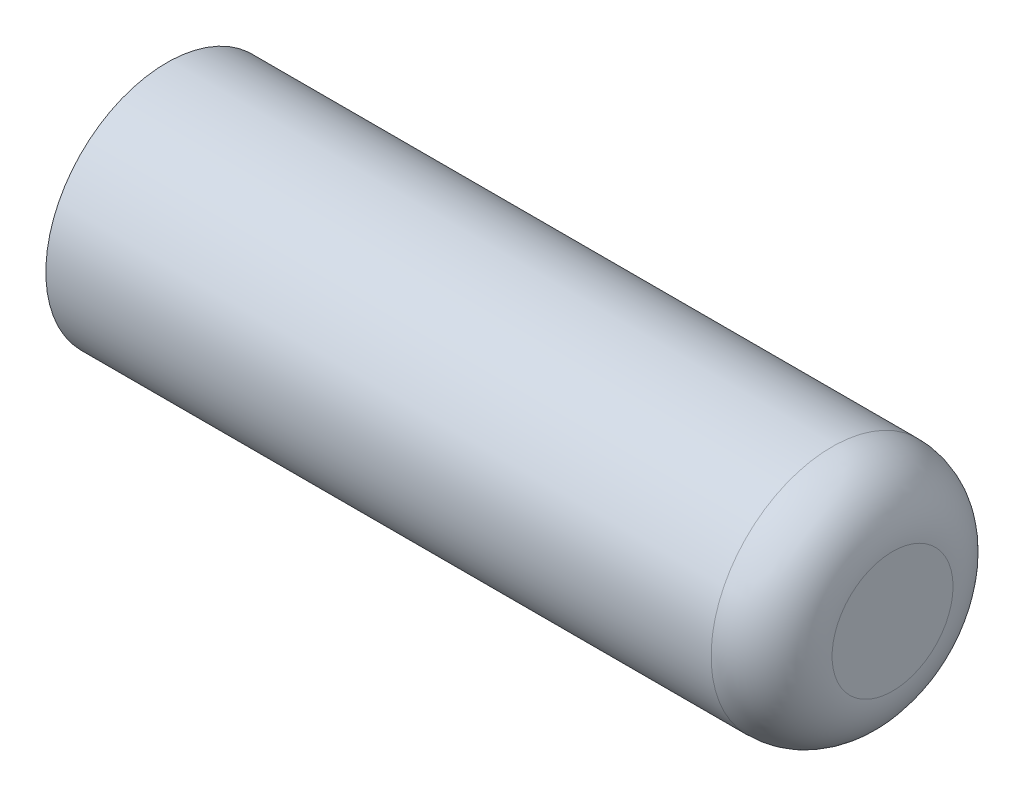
from build123d import *

# Parameters (mm, degrees)
SKETCH1_R      = 5
EXTRUDE1_DEPTH = 30
FILLET1_R      = 2.5
SKETCH2_R      = 1.5
EXTRUDE2_DEPTH = 10


with BuildPart() as part:
    # Sketch1 → Extrude1 (new body)
    with BuildSketch(Plane(origin=(0, 0, 0), x_dir=(0, 0, -1), z_dir=(1, 0, 0))):
        Circle(SKETCH1_R)
    extrude(amount=EXTRUDE1_DEPTH)

    # Fillet1
    fillet1_edges = [part.edges().sort_by_distance(p)[0] for p in [
        (30, 0, 5),
    ]]
    fillet(fillet1_edges, radius=FILLET1_R)

    # Sketch2 → Extrude2 (cut)
    with BuildSketch(Plane.ZY):
        Circle(SKETCH2_R)
    extrude(amount=-EXTRUDE2_DEPTH, mode=Mode.SUBTRACT)


solid = part.part
